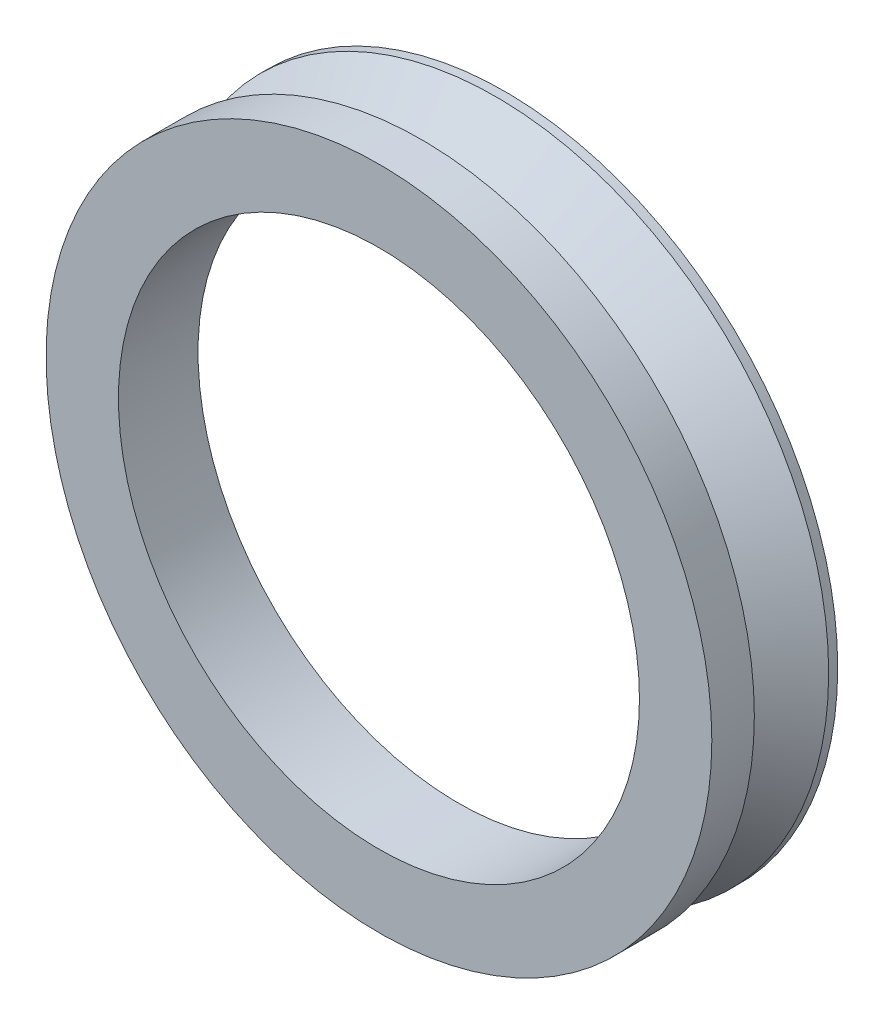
from build123d import *


with BuildPart() as part:
    # Esquisse1 → Base-R_volution (revolve)
    with BuildSketch(Plane(origin=(0, 0, 0), x_dir=(0, 0, -1), z_dir=(1, 0, 0)), mode=Mode.PRIVATE) as base_r_volution_sk:
        Polygon((0, 18), (5.5, 18), (8.7, 23), (8.075, 23), (4.394331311, 19), (2.938450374, 23), (0, 23), align=None)
    revolve(base_r_volution_sk.sketch.rotate(Axis((0, 0, 0), (0, 0, -1)), 90), axis=Axis((0, 0, 0), (0, 0, -1)))


solid = part.part
